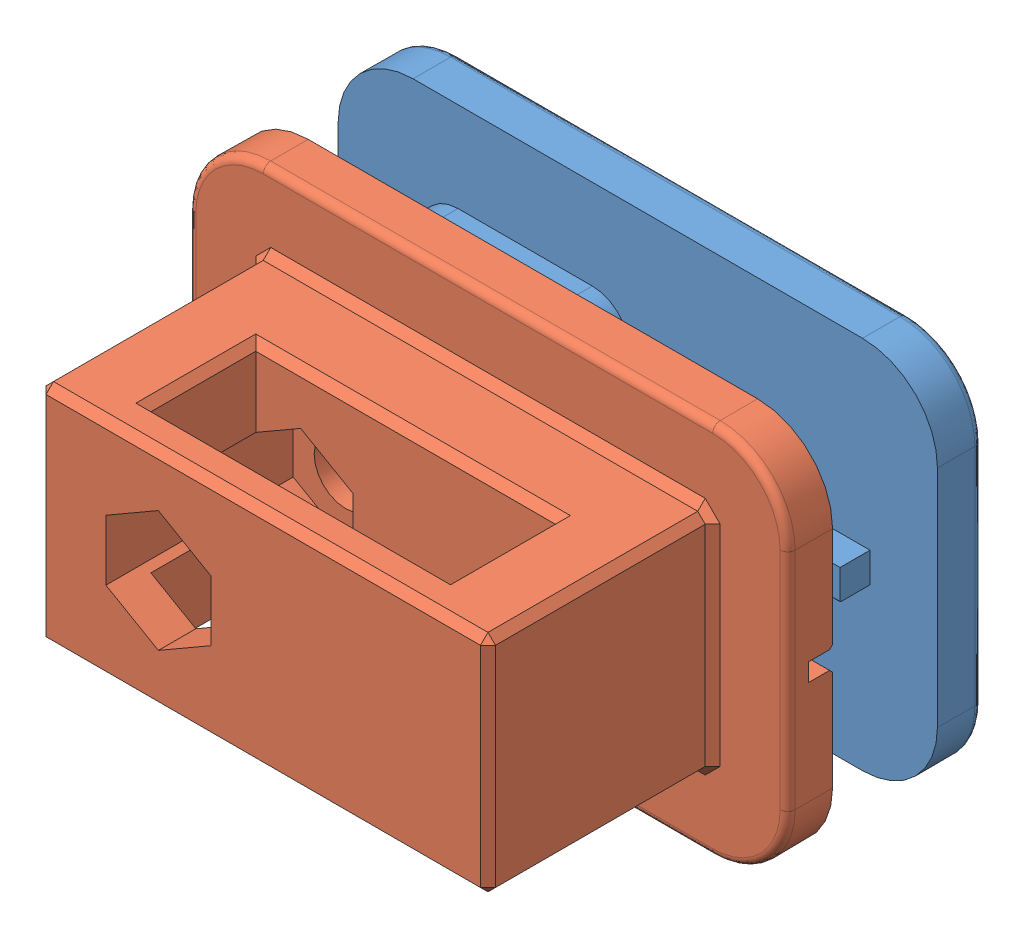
SolidWorks assembly Assemblage1.SLDASM, configuration Défaut (file format 9000). Lengths in mm.
Overall size (40 25 28).
2 component instances, 2 part files, 3 mates.
Components (placement in the parent):
- Support_1-1: Support_1.SLDPRT [Défaut] at (-17.3043 -12.2093 37.25) size (40 25 6.3)
- Support_2-1: Support_2.SLDPRT [Défaut] at (-17.3043 -12.2093 47.25) size (40 25 18)
Mates (geometry in assembly coordinates):
- Coïncidente1: coincident aligned: plane of Support_1-1 through (-12.3043 12.7907 40.25) normal (0 1 0); plane of Support_2-1 through (-12.3043 12.7907 50.25) normal (0 1 0)
- Coïncidente2: coincident aligned: plane of Support_1-1 through (-17.3043 -7.2093 40.25) normal (-1 0 0); plane of Support_2-1 through (-17.3043 -7.2093 50.25) normal (-1 0 0)
- Distance2: distance = 5 mm anti-aligned: plane of Support_2-1 through (17.6957 7.7907 47.25) normal (0 0 -1); plane of Support_1-1 through (-0.3398 4.2907 42.25) normal (0 0 1)
